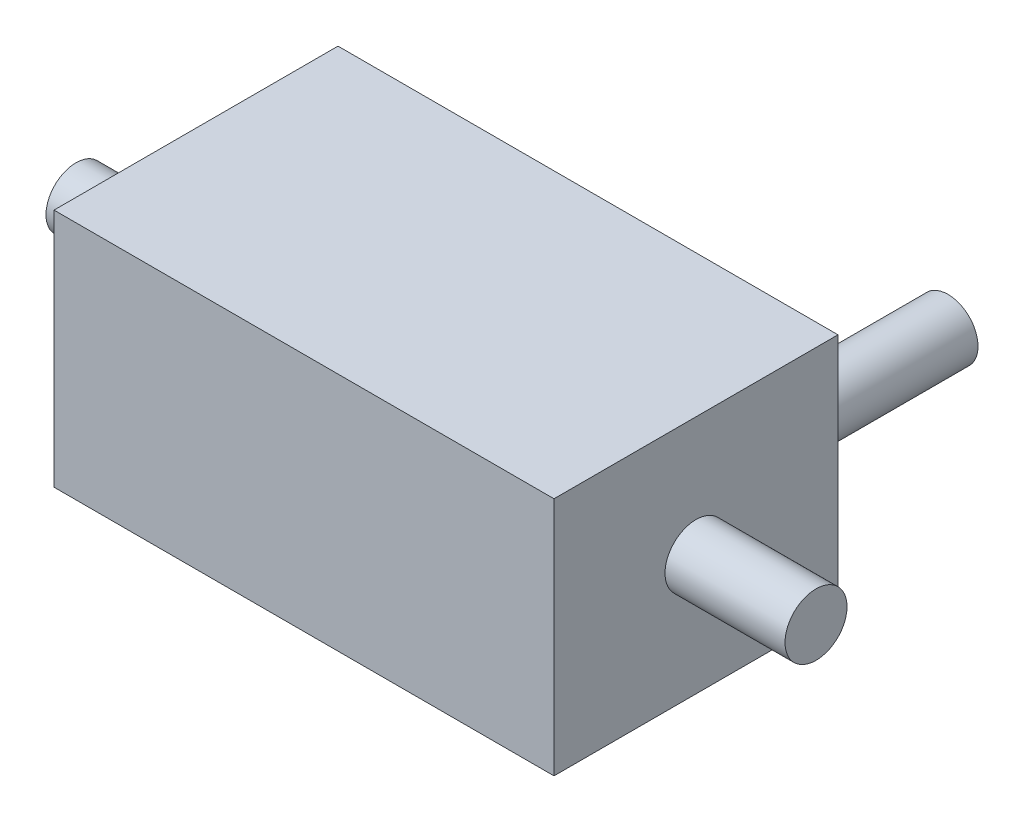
from build123d import *

# Parameters (mm, degrees)
SKETCH_1_W      = 25
SKETCH_1_H      = 14.2
EXTRUDE_1_DEPTH = 12
EXTRUDE_2_DEPTH = 5
SKETCH_3_R      = 1.55
EXTRUDE_3_DEPTH = 5
SKETCH_7_R      = 1.5
EXTRUDE_4_DEPTH = 9
SKETCH_8_R      = 1.55
EXTRUDE_5_DEPTH = 1
SKETCH_9_R      = 1.5
EXTRUDE_6_DEPTH = 1


with BuildPart() as part:
    # Sketch 1 → Extrude 1 (new body)
    with BuildSketch(Plane(origin=(0, 0, 0), x_dir=(1, 0, 0), z_dir=(0, 1, 0))):
        with Locations((12.5, 7.1)):
            Rectangle(SKETCH_1_W, SKETCH_1_H)
    extrude(amount=EXTRUDE_1_DEPTH)

    # Sketch 2 → Extrude 2 (add)
    with BuildSketch(Plane.ZY):
        with BuildLine():
            ThreePointArc((-5.954308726, 6.968189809), (-8.068189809, 7.145691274), (-8.245691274, 5.031810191))
            Line((-8.245691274, 5.031810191), (-5.954308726, 6.968189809))
        make_face()
        with BuildLine():
            Line((-5.954308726, 6.968189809), (-8.245691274, 5.031810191))
            ThreePointArc((-8.245691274, 5.031810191), (-6.584508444, 4.591359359), (-5.6, 6))
            ThreePointArc((-5.6, 6), (-5.691359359, 6.515491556), (-5.954308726, 6.968189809))
        make_face()
        with BuildLine():
            ThreePointArc((-5.954308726, 6.968189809), (-8.068189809, 7.145691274), (-8.245691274, 5.031810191))
            Line((-8.245691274, 5.031810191), (-5.954308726, 6.968189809))
        make_face()
        with BuildLine():
            Line((-5.954308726, 6.968189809), (-8.245691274, 5.031810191))
            ThreePointArc((-8.245691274, 5.031810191), (-6.584508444, 4.591359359), (-5.6, 6))
            ThreePointArc((-5.6, 6), (-5.691359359, 6.515491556), (-5.954308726, 6.968189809))
        make_face()
    extrude(amount=EXTRUDE_2_DEPTH)

    # Sketch 3 → Extrude 3 (add)
    with BuildSketch(Plane(origin=(25, 0, 0), x_dir=(0, 0, -1), z_dir=(1, 0, 0))):
        with Locations((7.1, 6)):
            Circle(SKETCH_3_R)
    extrude(amount=EXTRUDE_3_DEPTH)

    # Sketch 7 → Extrude 4 (add)
    with BuildSketch(Plane(origin=(0, 0, -14.2), x_dir=(-1, 0, 0), z_dir=(0, 0, -1))):
        with Locations(Location((-21.5, 6, 0), (0, 0, 180))):
            Circle(SKETCH_7_R)
    extrude(amount=EXTRUDE_4_DEPTH)

    # Sketch 8 → Extrude 5 (add)
    with BuildSketch(Plane(origin=(30, 0, 0), x_dir=(0, 0, -1), z_dir=(1, 0, 0))):
        with Locations((7.1, 6)):
            Circle(SKETCH_8_R)
    extrude(amount=EXTRUDE_5_DEPTH)

    # Sketch 9 → Extrude 6 (add)
    with BuildSketch(Plane.ZY.offset(5)):
        with Locations((-7.1, 6)):
            Circle(SKETCH_9_R)
    extrude(amount=EXTRUDE_6_DEPTH)


solid = part.part
